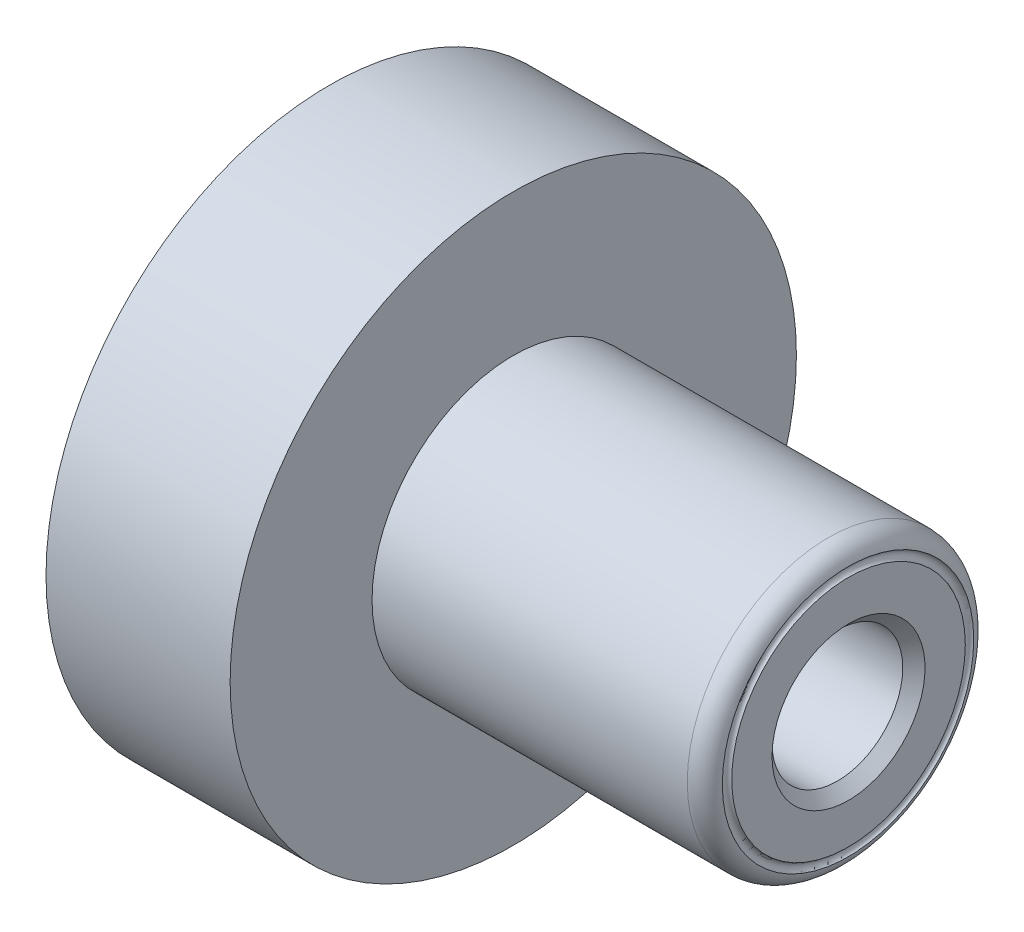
from build123d import *

# Parameters (mm, degrees)
SKETCH2_R          = 3.2004
CUT_EXTRUDE1_DEPTH = 7.9502
SKETCH3_R          = 5.13
CUT_EXTRUDE2_DEPTH = 52.476689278
CHAMFER1_SIZE      = 0.875
SKETCH4_R          = 0.381


with BuildPart() as part:
    # Sketch1 → Revolve1 (revolve)
    with BuildSketch(Plane.XY, mode=Mode.PRIVATE) as revolve1_sk:
        with BuildLine():
            Line((0, 8.128), (0, 22.225))
            Line((0, 22.225), (14.4526, 22.225))
            Line((14.4526, 22.225), (14.4526, 11.0871))
            Line((14.4526, 11.0871), (39.197, 11.0871))
            ThreePointArc((39.197, 11.0871), (40.307157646, 10.627257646), (40.767, 9.5171))
            Line((40.767, 9.5171), (40.767, 0))
            Line((40.767, 0), (28.067, 0))
            Line((28.067, 0), (28.067, 8.128))
            Line((28.067, 8.128), (0, 8.128))
        make_face()
    revolve(revolve1_sk.sketch.rotate(Axis((0, 0, 0), (1, 0, 0)), 90), axis=Axis((0, 0, 0), (1, 0, 0)))

    # Sketch2 → Cut-Extrude1 (cut)
    with BuildSketch(Plane.ZY):
        with Locations((-12.7, 0)):
            Circle(SKETCH2_R)
        with Locations(Location((12.7, 0, 0), (0, 0, 180))):
            Circle(SKETCH2_R)
    extrude(amount=-CUT_EXTRUDE1_DEPTH, mode=Mode.SUBTRACT)

    # Sketch3 → Cut-Extrude2 (cut, through all)
    with BuildSketch(Plane(origin=(40.767, 0, 0), x_dir=(0, 0, -1), z_dir=(1, 0, 0))):
        Circle(SKETCH3_R)
    extrude(amount=-CUT_EXTRUDE2_DEPTH, mode=Mode.SUBTRACT)

    # Chamfer1
    chamfer1_edges = [part.edges().sort_by_distance(p)[0] for p in [
        (40.767, 0, 5.13),
    ]]
    chamfer(chamfer1_edges, length=CHAMFER1_SIZE)

    # Sketch4 → Cut-Revolve1 (revolve, cut)
    with BuildSketch(Plane.XY, mode=Mode.PRIVATE) as cut_revolve1_sk:
        with Locations((40.897, 9.525)):
            Circle(SKETCH4_R)
    revolve(cut_revolve1_sk.sketch.rotate(Axis((0, 0, 0), (1, 0, 0)), 90), axis=Axis((0, 0, 0), (1, 0, 0)), mode=Mode.SUBTRACT)


solid = part.part
